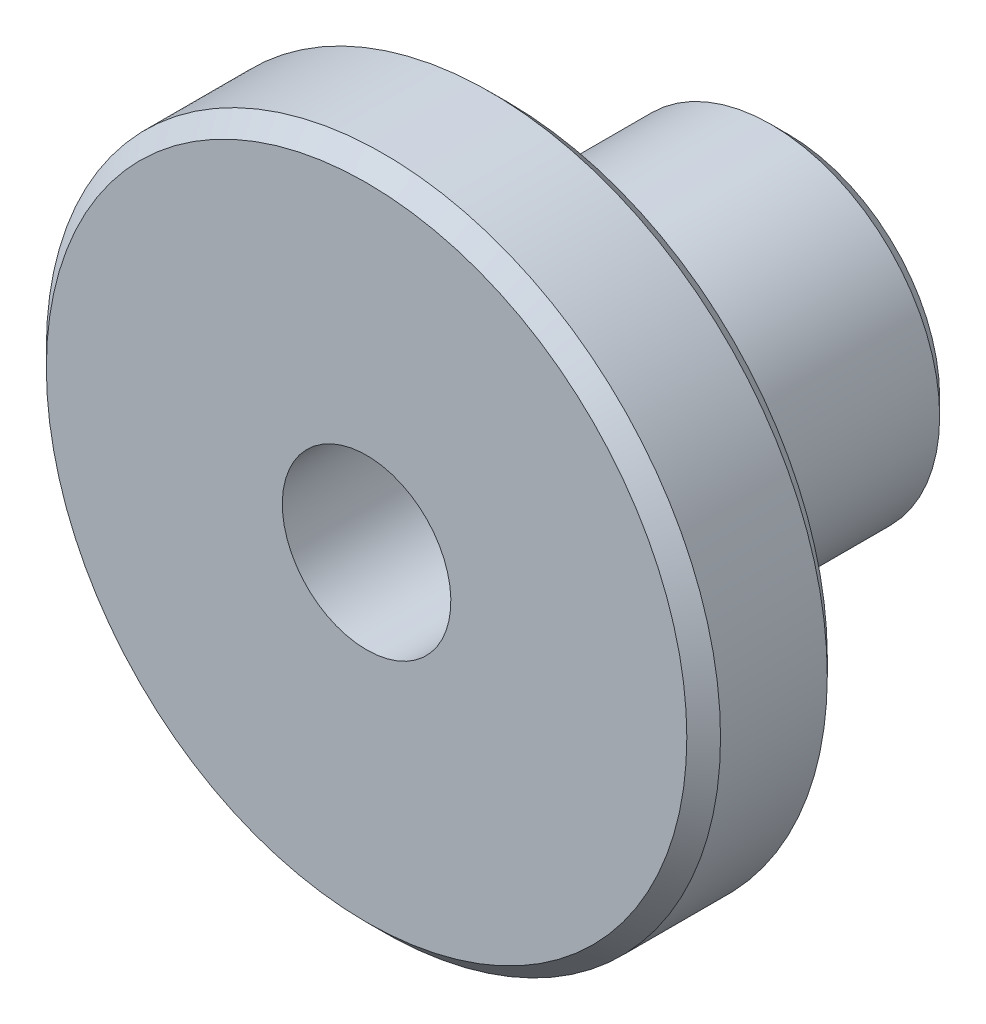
ISO-10303-21;
HEADER;
FILE_DESCRIPTION(('STEP AP214'),'2;1');
FILE_NAME('part.step','',(''),(''),'','','');
FILE_SCHEMA(('AUTOMOTIVE_DESIGN { 1 0 10303 214 1 1 1 1 }'));
ENDSEC;
DATA;
#1=APPLICATION_CONTEXT('core data for automotive mechanical design processes');
#2=APPLICATION_PROTOCOL_DEFINITION('international standard','automotive_design',2000,#1);
#3=PRODUCT_CONTEXT('',#1,'mechanical');
#4=PRODUCT('Part','Part','',(#3));
#5=PRODUCT_RELATED_PRODUCT_CATEGORY('part','',(#4));
#6=PRODUCT_DEFINITION_FORMATION('','',#4);
#7=PRODUCT_DEFINITION_CONTEXT('part definition',#1,'design');
#8=PRODUCT_DEFINITION('design','',#6,#7);
#9=PRODUCT_DEFINITION_SHAPE('','',#8);
#10=(LENGTH_UNIT() NAMED_UNIT(*) SI_UNIT(.MILLI.,.METRE.));
#11=(NAMED_UNIT(*) PLANE_ANGLE_UNIT() SI_UNIT($,.RADIAN.));
#12=(NAMED_UNIT(*) SI_UNIT($,.STERADIAN.) SOLID_ANGLE_UNIT());
#13=UNCERTAINTY_MEASURE_WITH_UNIT(LENGTH_MEASURE(1.E-05),#10,'distance_accuracy_value','');
#14=(GEOMETRIC_REPRESENTATION_CONTEXT(3) GLOBAL_UNCERTAINTY_ASSIGNED_CONTEXT((#13)) GLOBAL_UNIT_ASSIGNED_CONTEXT((#10,
#11,#12)) REPRESENTATION_CONTEXT('',''));
#15=CARTESIAN_POINT('',(0.,0.,0.));
#16=DIRECTION('',(0.,0.,1.));
#17=DIRECTION('',(1.,0.,0.));
#18=AXIS2_PLACEMENT_3D('',#15,#16,#17);
#19=CARTESIAN_POINT('',(-6.092893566,6.072,5.));
#20=DIRECTION('',(0.,0.,1.));
#21=DIRECTION('',(0.,-1.,0.));
#22=AXIS2_PLACEMENT_3D('',#19,#20,#21);
#23=PLANE('',#22);
#24=CARTESIAN_POINT('',(0.,0.,5.));
#25=DIRECTION('',(0.,0.,1.));
#26=DIRECTION('',(1.,0.,0.));
#27=AXIS2_PLACEMENT_3D('',#24,#25,#26);
#28=CIRCLE('',#27,3.5);
#29=CARTESIAN_POINT('',(3.5,0.,5.));
#30=VERTEX_POINT('',#29);
#31=EDGE_CURVE('E8',#30,#30,#28,.T.);
#32=ORIENTED_EDGE('',*,*,#31,.T.);
#33=EDGE_LOOP('',(#32));
#34=FACE_BOUND('',#33,.T.);
#35=CARTESIAN_POINT('',(0.,0.,5.));
#36=DIRECTION('',(0.,0.,1.));
#37=DIRECTION('',(1.,0.,0.));
#38=AXIS2_PLACEMENT_3D('',#35,#36,#37);
#39=CIRCLE('',#38,5.7);
#40=CARTESIAN_POINT('',(5.7,0.,5.));
#41=VERTEX_POINT('',#40);
#42=EDGE_CURVE('E27',#41,#41,#39,.F.);
#43=ORIENTED_EDGE('',*,*,#42,.T.);
#44=EDGE_LOOP('',(#43));
#45=FACE_BOUND('',#44,.T.);
#46=ADVANCED_FACE('F12',(#34,#45),#23,.F.);
#47=CARTESIAN_POINT('',(0.,0.,7.5));
#48=DIRECTION('',(0.,0.,-1.));
#49=DIRECTION('',(1.,0.,0.));
#50=AXIS2_PLACEMENT_3D('',#47,#48,#49);
#51=CYLINDRICAL_SURFACE('',#50,6.);
#52=CARTESIAN_POINT('',(0.,0.,5.3));
#53=DIRECTION('',(0.,0.,1.));
#54=DIRECTION('',(1.,0.,0.));
#55=AXIS2_PLACEMENT_3D('',#52,#53,#54);
#56=CIRCLE('',#55,6.);
#57=CARTESIAN_POINT('',(6.,0.,5.3));
#58=VERTEX_POINT('',#57);
#59=EDGE_CURVE('E32',#58,#58,#56,.T.);
#60=ORIENTED_EDGE('',*,*,#59,.T.);
#61=EDGE_LOOP('',(#60));
#62=FACE_BOUND('',#61,.T.);
#63=CARTESIAN_POINT('',(0.,0.,7.2));
#64=DIRECTION('',(0.,0.,1.));
#65=DIRECTION('',(1.,0.,0.));
#66=AXIS2_PLACEMENT_3D('',#63,#64,#65);
#67=CIRCLE('',#66,6.);
#68=CARTESIAN_POINT('',(6.,0.,7.2));
#69=VERTEX_POINT('',#68);
#70=EDGE_CURVE('E35',#69,#69,#67,.F.);
#71=ORIENTED_EDGE('',*,*,#70,.T.);
#72=EDGE_LOOP('',(#71));
#73=FACE_BOUND('',#72,.T.);
#74=ADVANCED_FACE('F77',(#62,#73),#51,.T.);
#75=CARTESIAN_POINT('',(0.,0.,5.));
#76=DIRECTION('',(0.,0.,-1.));
#77=DIRECTION('',(0.,1.,0.));
#78=AXIS2_PLACEMENT_3D('',#75,#76,#77);
#79=CYLINDRICAL_SURFACE('',#78,3.);
#80=CARTESIAN_POINT('',(0.,0.,4.5));
#81=DIRECTION('',(0.,0.,1.));
#82=DIRECTION('',(1.,0.,0.));
#83=AXIS2_PLACEMENT_3D('',#80,#81,#82);
#84=CIRCLE('',#83,3.);
#85=CARTESIAN_POINT('',(3.,0.,4.5));
#86=VERTEX_POINT('',#85);
#87=EDGE_CURVE('E19',#86,#86,#84,.F.);
#88=ORIENTED_EDGE('',*,*,#87,.T.);
#89=EDGE_LOOP('',(#88));
#90=FACE_BOUND('',#89,.T.);
#91=CARTESIAN_POINT('',(0.,0.,0.299999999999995));
#92=DIRECTION('',(0.,0.,1.));
#93=DIRECTION('',(1.,0.,0.));
#94=AXIS2_PLACEMENT_3D('',#91,#92,#93);
#95=CIRCLE('',#94,3.);
#96=CARTESIAN_POINT('',(3.,0.,0.299999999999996));
#97=VERTEX_POINT('',#96);
#98=EDGE_CURVE('E41',#97,#97,#95,.T.);
#99=ORIENTED_EDGE('',*,*,#98,.T.);
#100=EDGE_LOOP('',(#99));
#101=FACE_BOUND('',#100,.T.);
#102=ADVANCED_FACE('F73',(#90,#101),#79,.T.);
#103=CARTESIAN_POINT('',(-6.092893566,6.072,7.5));
#104=DIRECTION('',(0.,0.,1.));
#105=DIRECTION('',(0.,-1.,0.));
#106=AXIS2_PLACEMENT_3D('',#103,#104,#105);
#107=PLANE('',#106);
#108=CARTESIAN_POINT('',(0.,0.,7.5));
#109=DIRECTION('',(0.,0.,1.));
#110=DIRECTION('',(1.,0.,0.));
#111=AXIS2_PLACEMENT_3D('',#108,#109,#110);
#112=CIRCLE('',#111,5.7);
#113=CARTESIAN_POINT('',(5.7,0.,7.5));
#114=VERTEX_POINT('',#113);
#115=EDGE_CURVE('E23',#114,#114,#112,.T.);
#116=ORIENTED_EDGE('',*,*,#115,.T.);
#117=EDGE_LOOP('',(#116));
#118=FACE_BOUND('',#117,.T.);
#119=CARTESIAN_POINT('',(0.,0.,7.5));
#120=DIRECTION('',(0.,0.,1.));
#121=DIRECTION('',(0.,-1.,0.));
#122=AXIS2_PLACEMENT_3D('',#119,#120,#121);
#123=CIRCLE('',#122,1.5);
#124=CARTESIAN_POINT('',(0.,-1.5,7.5));
#125=VERTEX_POINT('',#124);
#126=EDGE_CURVE('E45',#125,#125,#123,.F.);
#127=ORIENTED_EDGE('',*,*,#126,.T.);
#128=EDGE_LOOP('',(#127));
#129=FACE_BOUND('',#128,.T.);
#130=ADVANCED_FACE('F67',(#118,#129),#107,.T.);
#131=CARTESIAN_POINT('',(-3.046446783,3.036,0.));
#132=DIRECTION('',(0.,0.,1.));
#133=DIRECTION('',(0.,-1.,0.));
#134=AXIS2_PLACEMENT_3D('',#131,#132,#133);
#135=PLANE('',#134);
#136=CARTESIAN_POINT('',(0.,0.,0.));
#137=DIRECTION('',(0.,0.,1.));
#138=DIRECTION('',(1.,0.,0.));
#139=AXIS2_PLACEMENT_3D('',#136,#137,#138);
#140=CIRCLE('',#139,2.7);
#141=CARTESIAN_POINT('',(2.7,0.,0.));
#142=VERTEX_POINT('',#141);
#143=EDGE_CURVE('E38',#142,#142,#140,.F.);
#144=ORIENTED_EDGE('',*,*,#143,.T.);
#145=EDGE_LOOP('',(#144));
#146=FACE_BOUND('',#145,.T.);
#147=CARTESIAN_POINT('',(0.,0.,0.));
#148=DIRECTION('',(0.,0.,1.));
#149=DIRECTION('',(0.,-1.,0.));
#150=AXIS2_PLACEMENT_3D('',#147,#148,#149);
#151=CIRCLE('',#150,1.5);
#152=CARTESIAN_POINT('',(0.,-1.5,0.));
#153=VERTEX_POINT('',#152);
#154=EDGE_CURVE('E44',#153,#153,#151,.T.);
#155=ORIENTED_EDGE('',*,*,#154,.T.);
#156=EDGE_LOOP('',(#155));
#157=FACE_BOUND('',#156,.T.);
#158=ADVANCED_FACE('F51',(#146,#157),#135,.F.);
#159=CARTESIAN_POINT('',(0.,0.,0.));
#160=DIRECTION('',(0.,0.,1.));
#161=DIRECTION('',(0.,-1.,0.));
#162=AXIS2_PLACEMENT_3D('',#159,#160,#161);
#163=CYLINDRICAL_SURFACE('',#162,1.5);
#164=ORIENTED_EDGE('',*,*,#126,.F.);
#165=EDGE_LOOP('',(#164));
#166=FACE_BOUND('',#165,.T.);
#167=ORIENTED_EDGE('',*,*,#154,.F.);
#168=EDGE_LOOP('',(#167));
#169=FACE_BOUND('',#168,.T.);
#170=ADVANCED_FACE('F53',(#166,#169),#163,.F.);
#171=CARTESIAN_POINT('',(0.,0.,0.299999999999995));
#172=DIRECTION('',(0.,0.,1.));
#173=DIRECTION('',(1.,0.,0.));
#174=AXIS2_PLACEMENT_3D('',#171,#172,#173);
#175=CONICAL_SURFACE('',#174,3.,0.785398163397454);
#176=ORIENTED_EDGE('',*,*,#143,.F.);
#177=EDGE_LOOP('',(#176));
#178=FACE_BOUND('',#177,.T.);
#179=ORIENTED_EDGE('',*,*,#98,.F.);
#180=EDGE_LOOP('',(#179));
#181=FACE_BOUND('',#180,.T.);
#182=ADVANCED_FACE('F55',(#178,#181),#175,.T.);
#183=CARTESIAN_POINT('',(0.,0.,5.3));
#184=DIRECTION('',(0.,0.,1.));
#185=DIRECTION('',(1.,0.,0.));
#186=AXIS2_PLACEMENT_3D('',#183,#184,#185);
#187=CONICAL_SURFACE('',#186,6.,0.785398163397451);
#188=ORIENTED_EDGE('',*,*,#42,.F.);
#189=EDGE_LOOP('',(#188));
#190=FACE_BOUND('',#189,.T.);
#191=ORIENTED_EDGE('',*,*,#59,.F.);
#192=EDGE_LOOP('',(#191));
#193=FACE_BOUND('',#192,.T.);
#194=ADVANCED_FACE('F64',(#190,#193),#187,.T.);
#195=CARTESIAN_POINT('',(0.,0.,7.5));
#196=DIRECTION('',(0.,0.,-1.));
#197=DIRECTION('',(-1.,0.,0.));
#198=AXIS2_PLACEMENT_3D('',#195,#196,#197);
#199=CONICAL_SURFACE('',#198,5.7,0.785398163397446);
#200=ORIENTED_EDGE('',*,*,#70,.F.);
#201=EDGE_LOOP('',(#200));
#202=FACE_BOUND('',#201,.T.);
#203=ORIENTED_EDGE('',*,*,#115,.F.);
#204=EDGE_LOOP('',(#203));
#205=FACE_BOUND('',#204,.T.);
#206=ADVANCED_FACE('F82',(#202,#205),#199,.T.);
#207=CARTESIAN_POINT('',(0.,0.,4.5));
#208=DIRECTION('',(0.,0.,1.));
#209=DIRECTION('',(1.,0.,0.));
#210=AXIS2_PLACEMENT_3D('',#207,#208,#209);
#211=TOROIDAL_SURFACE('',#210,3.5,0.5);
#212=ORIENTED_EDGE('',*,*,#31,.F.);
#213=EDGE_LOOP('',(#212));
#214=FACE_BOUND('',#213,.T.);
#215=ORIENTED_EDGE('',*,*,#87,.F.);
#216=EDGE_LOOP('',(#215));
#217=FACE_BOUND('',#216,.T.);
#218=ADVANCED_FACE('F14',(#214,#217),#211,.F.);
#219=CLOSED_SHELL('',(#46,#74,#102,#130,#158,#170,#182,#194,#206,#218));
#220=MANIFOLD_SOLID_BREP('B1',#219);
#221=ADVANCED_BREP_SHAPE_REPRESENTATION('',(#18,#220),#14);
#222=SHAPE_DEFINITION_REPRESENTATION(#9,#221);
ENDSEC;
END-ISO-10303-21;
